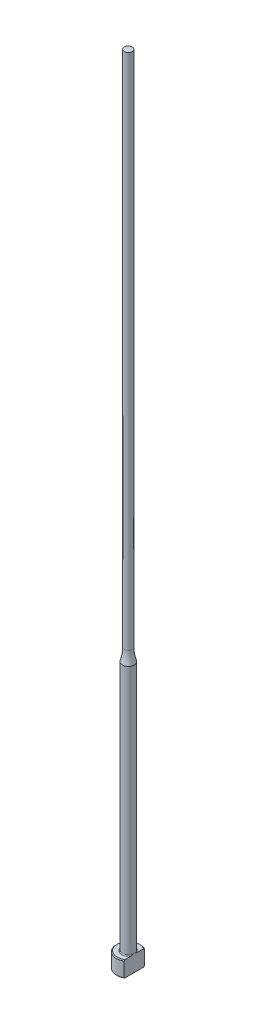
from build123d import *
from build123d.topology import SkipClean

# Parameters (mm, degrees)
CHAMFER1_SIZE    = 0.2
FILLET1_R        = 0.2
KEYED_HEAD_DEPTH = 201.044994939


with BuildPart() as part:
    # Sketch1 → Revolve1 (revolve)
    with BuildSketch(Plane.XY, mode=Mode.PRIVATE) as revolve1_sk:
        with BuildLine():
            Line((0, 0), (-3, 0))
            Line((-3, 0), (-3, 4))
            Line((-3, 4), (-1.5, 4))
            Line((-1.5, 4), (-1.5, 66.877501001))
            ThreePointArc((-1.5, 66.877501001), (-1.125791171, 68.41886117), (-1, 70))
            Line((-1, 70), (-1, 200))
            Line((-1, 200), (0, 200))
            Line((0, 200), (0, 0))
        make_face()
    revolve(revolve1_sk.sketch.rotate(Axis((0, 259.958771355, 0), (0, -1, 0)), 270), axis=Axis((0, 259.958771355, 0), (0, -1, 0)))

    # Chamfer1
    chamfer1_edges = [part.edges().sort_by_distance(p)[0] for p in [
        (0, 0, -3),
        (0, 4, -3),
    ]]
    chamfer(chamfer1_edges, length=CHAMFER1_SIZE)

    # Fillet1
    fillet1_edges = [part.edges().sort_by_distance(p)[0] for p in [
        (0, 4, -1.5),
    ]]
    fillet(fillet1_edges, radius=FILLET1_R)

    # Sketch2 → Keyed Head (cut, through all)
    with SkipClean():  # the faces are left unmerged after this step: merging them gives an invalid solid
        with BuildSketch(Plane(origin=(0, 0, 0), x_dir=(1, 0, 0), z_dir=(0, 1, 0))):
            with BuildLine():
                Line((1.5, -2.598076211), (1.5, 2.598076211))
                ThreePointArc((1.5, 2.598076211), (3, 0), (1.5, -2.598076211))
            make_face()
        extrude(amount=KEYED_HEAD_DEPTH, mode=Mode.SUBTRACT)


solid = part.part
